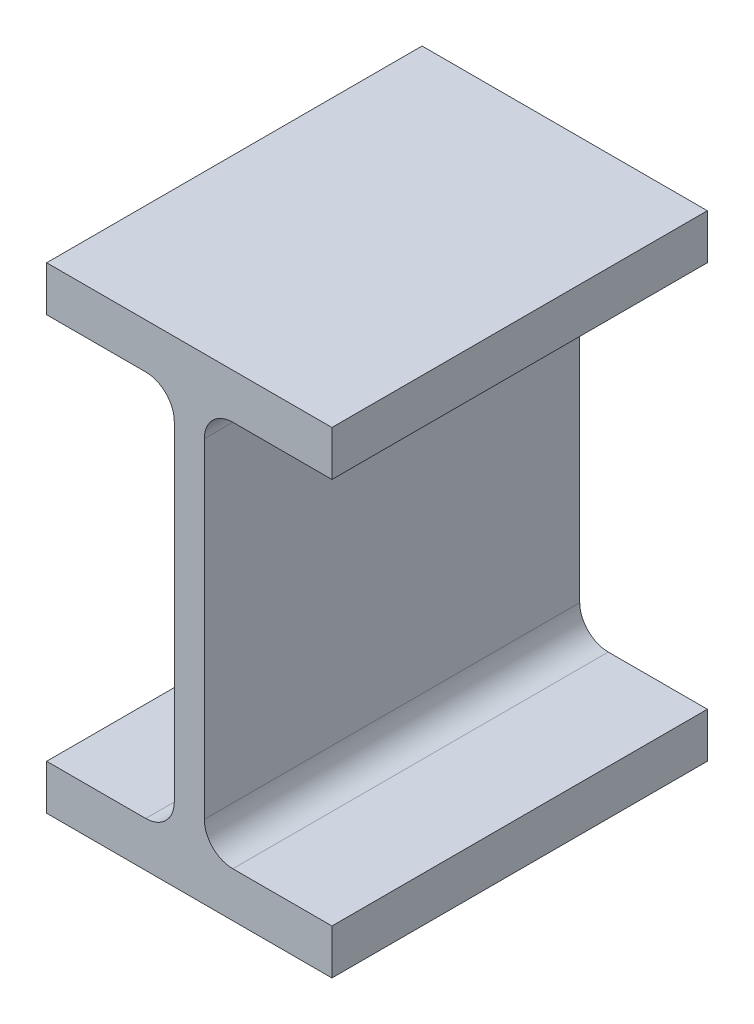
from build123d import *

# Parameters (mm, degrees)
EXTRUDE1_DEPTH = 50


with BuildPart() as part:
    # Sketch1 → Extrude1 (new, symmetric)
    with BuildSketch(Plane.XY):
        with BuildLine():
            Line((-38, 0), (38, 0))
            Line((38, 0), (38, 12))
            Line((38, 12), (11.6, 12))
            ThreePointArc((11.6, 12), (6.225988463, 14.225988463), (4, 19.6))
            Line((4, 19.6), (4, 107.4))
            ThreePointArc((4, 107.4), (6.225988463, 112.774011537), (11.6, 115))
            Line((11.6, 115), (38, 115))
            Line((38, 115), (38, 127))
            Line((38, 127), (-38, 127))
            Line((-38, 127), (-38, 115))
            Line((-38, 115), (-11.6, 115))
            ThreePointArc((-11.6, 115), (-6.225988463, 112.774011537), (-4, 107.4))
            Line((-4, 107.4), (-4, 19.6))
            ThreePointArc((-4, 19.6), (-6.225988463, 14.225988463), (-11.6, 12))
            Line((-11.6, 12), (-38, 12))
            Line((-38, 12), (-38, 0))
        make_face()
    extrude(amount=EXTRUDE1_DEPTH, both=True)


solid = part.part
